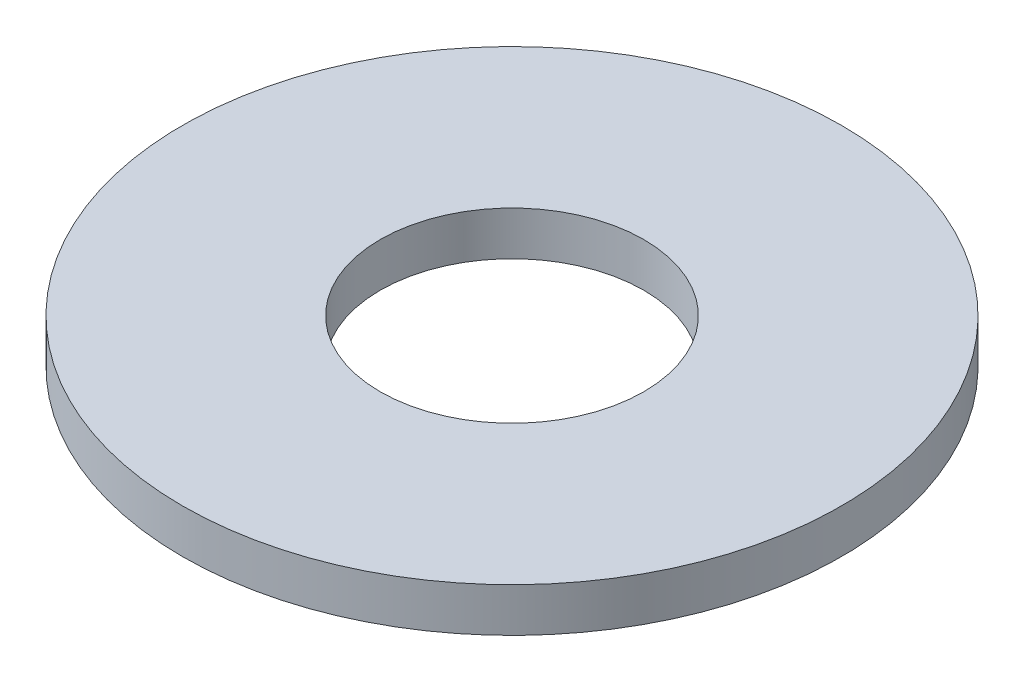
ISO-10303-21;
HEADER;
FILE_DESCRIPTION(('STEP AP214'),'2;1');
FILE_NAME('part.step','',(''),(''),'','','');
FILE_SCHEMA(('AUTOMOTIVE_DESIGN { 1 0 10303 214 1 1 1 1 }'));
ENDSEC;
DATA;
#1=APPLICATION_CONTEXT('core data for automotive mechanical design processes');
#2=APPLICATION_PROTOCOL_DEFINITION('international standard','automotive_design',2000,#1);
#3=PRODUCT_CONTEXT('',#1,'mechanical');
#4=PRODUCT('Part','Part','',(#3));
#5=PRODUCT_RELATED_PRODUCT_CATEGORY('part','',(#4));
#6=PRODUCT_DEFINITION_FORMATION('','',#4);
#7=PRODUCT_DEFINITION_CONTEXT('part definition',#1,'design');
#8=PRODUCT_DEFINITION('design','',#6,#7);
#9=PRODUCT_DEFINITION_SHAPE('','',#8);
#10=(LENGTH_UNIT() NAMED_UNIT(*) SI_UNIT(.MILLI.,.METRE.));
#11=(NAMED_UNIT(*) PLANE_ANGLE_UNIT() SI_UNIT($,.RADIAN.));
#12=(NAMED_UNIT(*) SI_UNIT($,.STERADIAN.) SOLID_ANGLE_UNIT());
#13=UNCERTAINTY_MEASURE_WITH_UNIT(LENGTH_MEASURE(1.E-05),#10,'distance_accuracy_value','');
#14=(GEOMETRIC_REPRESENTATION_CONTEXT(3) GLOBAL_UNCERTAINTY_ASSIGNED_CONTEXT((#13)) GLOBAL_UNIT_ASSIGNED_CONTEXT((#10,
#11,#12)) REPRESENTATION_CONTEXT('',''));
#15=CARTESIAN_POINT('',(0.,0.,0.));
#16=DIRECTION('',(0.,0.,1.));
#17=DIRECTION('',(1.,0.,0.));
#18=AXIS2_PLACEMENT_3D('',#15,#16,#17);
#19=CARTESIAN_POINT('',(0.,0.3,0.));
#20=DIRECTION('',(0.,1.,0.));
#21=DIRECTION('',(0.,0.,1.));
#22=AXIS2_PLACEMENT_3D('',#19,#20,#21);
#23=PLANE('',#22);
#24=CARTESIAN_POINT('',(0.,0.3,0.));
#25=DIRECTION('',(0.,1.,0.));
#26=DIRECTION('',(0.,0.,1.));
#27=AXIS2_PLACEMENT_3D('',#24,#25,#26);
#28=CIRCLE('',#27,2.25);
#29=CARTESIAN_POINT('',(0.,0.3,2.25));
#30=VERTEX_POINT('',#29);
#31=EDGE_CURVE('E10',#30,#30,#28,.T.);
#32=ORIENTED_EDGE('',*,*,#31,.T.);
#33=EDGE_LOOP('',(#32));
#34=FACE_BOUND('',#33,.T.);
#35=CARTESIAN_POINT('',(0.,0.3,0.));
#36=DIRECTION('',(0.,1.,0.));
#37=DIRECTION('',(0.,0.,1.));
#38=AXIS2_PLACEMENT_3D('',#35,#36,#37);
#39=CIRCLE('',#38,0.9);
#40=CARTESIAN_POINT('',(0.,0.3,0.9));
#41=VERTEX_POINT('',#40);
#42=EDGE_CURVE('E39',#41,#41,#39,.T.);
#43=ORIENTED_EDGE('',*,*,#42,.F.);
#44=EDGE_LOOP('',(#43));
#45=FACE_BOUND('',#44,.T.);
#46=ADVANCED_FACE('F28',(#34,#45),#23,.T.);
#47=CARTESIAN_POINT('',(0.,0.,0.));
#48=DIRECTION('',(0.,1.,0.));
#49=DIRECTION('',(0.,0.,1.));
#50=AXIS2_PLACEMENT_3D('',#47,#48,#49);
#51=PLANE('',#50);
#52=CARTESIAN_POINT('',(0.,0.,0.));
#53=DIRECTION('',(0.,1.,0.));
#54=DIRECTION('',(0.,0.,1.));
#55=AXIS2_PLACEMENT_3D('',#52,#53,#54);
#56=CIRCLE('',#55,2.25);
#57=CARTESIAN_POINT('',(0.,0.,2.25));
#58=VERTEX_POINT('',#57);
#59=EDGE_CURVE('E35',#58,#58,#56,.T.);
#60=ORIENTED_EDGE('',*,*,#59,.F.);
#61=EDGE_LOOP('',(#60));
#62=FACE_BOUND('',#61,.T.);
#63=CARTESIAN_POINT('',(0.,0.,0.));
#64=DIRECTION('',(0.,1.,0.));
#65=DIRECTION('',(0.,0.,1.));
#66=AXIS2_PLACEMENT_3D('',#63,#64,#65);
#67=CIRCLE('',#66,0.9);
#68=CARTESIAN_POINT('',(0.,0.,0.9));
#69=VERTEX_POINT('',#68);
#70=EDGE_CURVE('E43',#69,#69,#67,.T.);
#71=ORIENTED_EDGE('',*,*,#70,.T.);
#72=EDGE_LOOP('',(#71));
#73=FACE_BOUND('',#72,.T.);
#74=ADVANCED_FACE('F49',(#62,#73),#51,.F.);
#75=CARTESIAN_POINT('',(0.,0.3,0.));
#76=DIRECTION('',(0.,-1.,0.));
#77=DIRECTION('',(0.,0.,-1.));
#78=AXIS2_PLACEMENT_3D('',#75,#76,#77);
#79=CYLINDRICAL_SURFACE('',#78,2.25);
#80=ORIENTED_EDGE('',*,*,#31,.F.);
#81=EDGE_LOOP('',(#80));
#82=FACE_BOUND('',#81,.T.);
#83=ORIENTED_EDGE('',*,*,#59,.T.);
#84=EDGE_LOOP('',(#83));
#85=FACE_BOUND('',#84,.T.);
#86=ADVANCED_FACE('F30',(#82,#85),#79,.T.);
#87=CARTESIAN_POINT('',(0.,0.3,0.));
#88=DIRECTION('',(0.,-1.,0.));
#89=DIRECTION('',(0.,0.,-1.));
#90=AXIS2_PLACEMENT_3D('',#87,#88,#89);
#91=CYLINDRICAL_SURFACE('',#90,0.9);
#92=ORIENTED_EDGE('',*,*,#42,.T.);
#93=EDGE_LOOP('',(#92));
#94=FACE_BOUND('',#93,.T.);
#95=ORIENTED_EDGE('',*,*,#70,.F.);
#96=EDGE_LOOP('',(#95));
#97=FACE_BOUND('',#96,.T.);
#98=ADVANCED_FACE('F51',(#94,#97),#91,.F.);
#99=CLOSED_SHELL('',(#46,#74,#86,#98));
#100=MANIFOLD_SOLID_BREP('B2',#99);
#101=ADVANCED_BREP_SHAPE_REPRESENTATION('',(#18,#100),#14);
#102=SHAPE_DEFINITION_REPRESENTATION(#9,#101);
ENDSEC;
END-ISO-10303-21;
